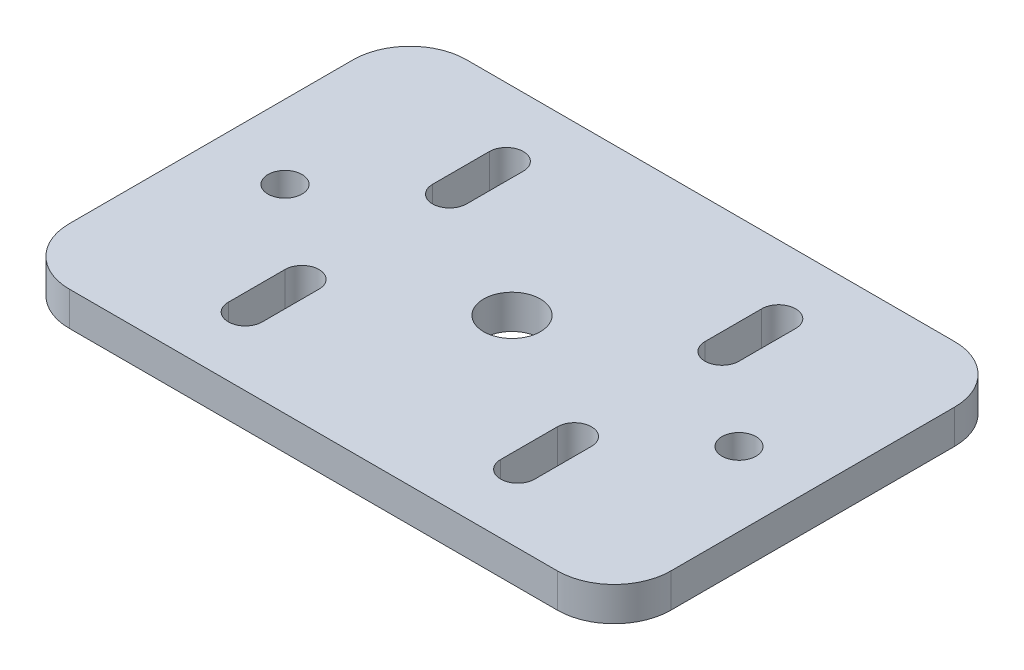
from build123d import *

# Parameters (mm, degrees)
SKETCH1_W      = 106
SKETCH1_H      = 70
SKETCH1_R      = 5
SKETCH1_R_2    = 3
EXTRUDE1_DEPTH = 6
FILLET1_R      = 10


with BuildPart() as part:
    # Sketch1 → Extrude1 (new body)
    with BuildSketch(Plane(origin=(0, 0, 0), x_dir=(1, 0, 0), z_dir=(0, 1, 0))):
        with Locations((53, 35)):
            Rectangle(SKETCH1_W, SKETCH1_H)
        with Locations(Location((53, 35, 0), (0, 0, 270))):
            Circle(SKETCH1_R, mode=Mode.SUBTRACT)
        with Locations(Location((13, 35, 0), (0, 0, 270))):
            Circle(SKETCH1_R_2, mode=Mode.SUBTRACT)
        with Locations(Location((93, 35, 0), (0, 0, 270))):
            Circle(SKETCH1_R_2, mode=Mode.SUBTRACT)
        with BuildLine():
            Line((26, 58), (26, 48))
            ThreePointArc((26, 48), (29, 45), (32, 48))
            Line((32, 48), (32, 58))
            ThreePointArc((32, 58), (29, 61), (26, 58))
        make_face(mode=Mode.SUBTRACT)
        with BuildLine():
            Line((80, 58), (80, 48))
            ThreePointArc((80, 48), (77, 45), (74, 48))
            Line((74, 48), (74, 58))
            ThreePointArc((74, 58), (77, 61), (80, 58))
        make_face(mode=Mode.SUBTRACT)
        with BuildLine():
            Line((32, 22), (32, 12))
            ThreePointArc((32, 12), (29, 9), (26, 12))
            Line((26, 12), (26, 22))
            ThreePointArc((26, 22), (29, 25), (32, 22))
        make_face(mode=Mode.SUBTRACT)
        with BuildLine():
            Line((80, 22), (80, 12))
            ThreePointArc((80, 12), (77, 9), (74, 12))
            Line((74, 12), (74, 22))
            ThreePointArc((74, 22), (77, 25), (80, 22))
        make_face(mode=Mode.SUBTRACT)
    extrude(amount=EXTRUDE1_DEPTH)

    # Fillet1
    fillet1_edges = [part.edges().sort_by_distance(p)[0] for p in [
        (0, 3, -70),
        (106, 3, -70),
        (106, 3, 0),
        (0, 3, 0),
    ]]
    fillet(fillet1_edges, radius=FILLET1_R)


solid = part.part
